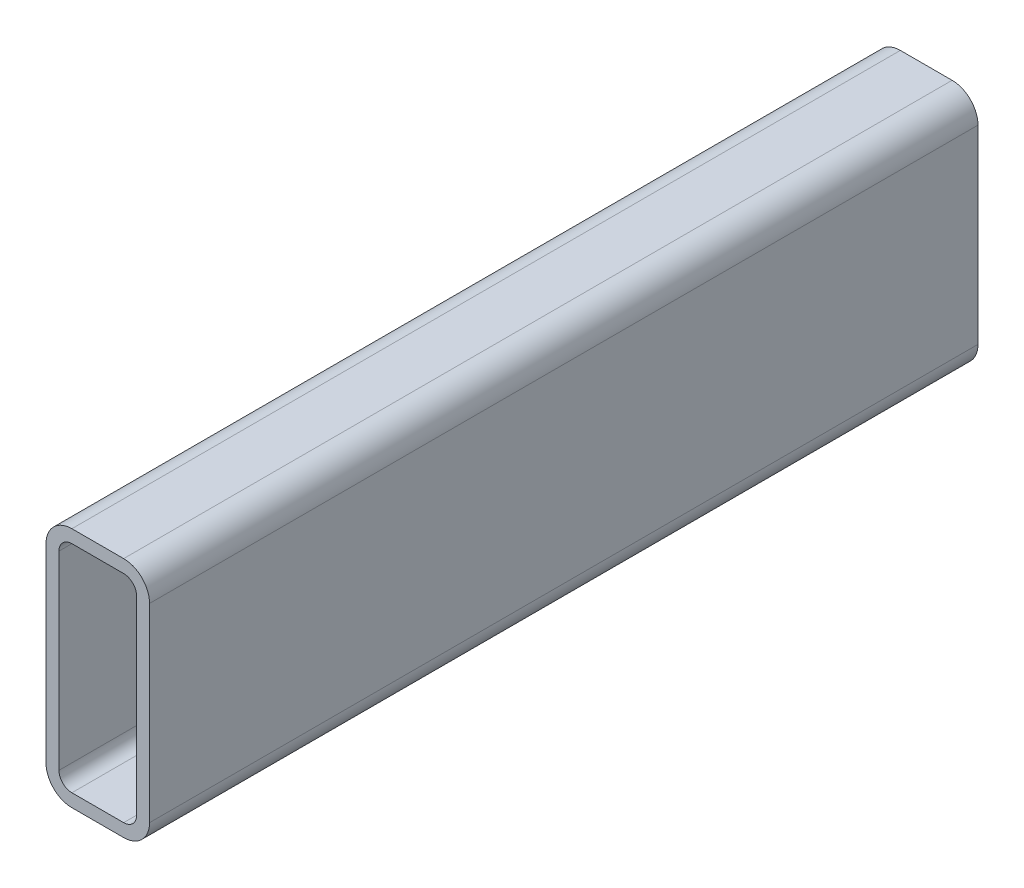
from build123d import *

# Parameters (mm, degrees)
BOSS_EXTRUDE1_DEPTH = 304.8


with BuildPart() as part:
    # Sketch1 → Boss-Extrude1 (new body)
    with BuildSketch(Plane.XY):
        with BuildLine():
            Line((28.575, 88.9), (9.525, 88.9))
            ThreePointArc((9.525, 88.9), (2.789807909, 86.110192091), (0, 79.375))
            Line((0, 79.375), (0, 9.525))
            ThreePointArc((0, 9.525), (2.789807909, 2.789807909), (9.525, 0))
            Line((9.525, 0), (28.575, 0))
            ThreePointArc((28.575, 0), (35.310192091, 2.789807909), (38.1, 9.525))
            Line((38.1, 9.525), (38.1, 79.375))
            ThreePointArc((38.1, 79.375), (35.310192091, 86.110192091), (28.575, 88.9))
        make_face()
        with BuildLine():
            Line((9.525, 84.1375), (28.575, 84.1375))
            ThreePointArc((28.575, 84.1375), (31.942596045, 82.742596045), (33.3375, 79.375))
            Line((33.3375, 79.375), (33.3375, 9.525))
            ThreePointArc((33.3375, 9.525), (31.942596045, 6.157403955), (28.575, 4.7625))
            Line((28.575, 4.7625), (9.525, 4.7625))
            ThreePointArc((9.525, 4.7625), (6.157403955, 6.157403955), (4.7625, 9.525))
            Line((4.7625, 9.525), (4.7625, 79.375))
            ThreePointArc((4.7625, 79.375), (6.157403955, 82.742596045), (9.525, 84.1375))
        make_face(mode=Mode.SUBTRACT)
    extrude(amount=BOSS_EXTRUDE1_DEPTH)


solid = part.part
